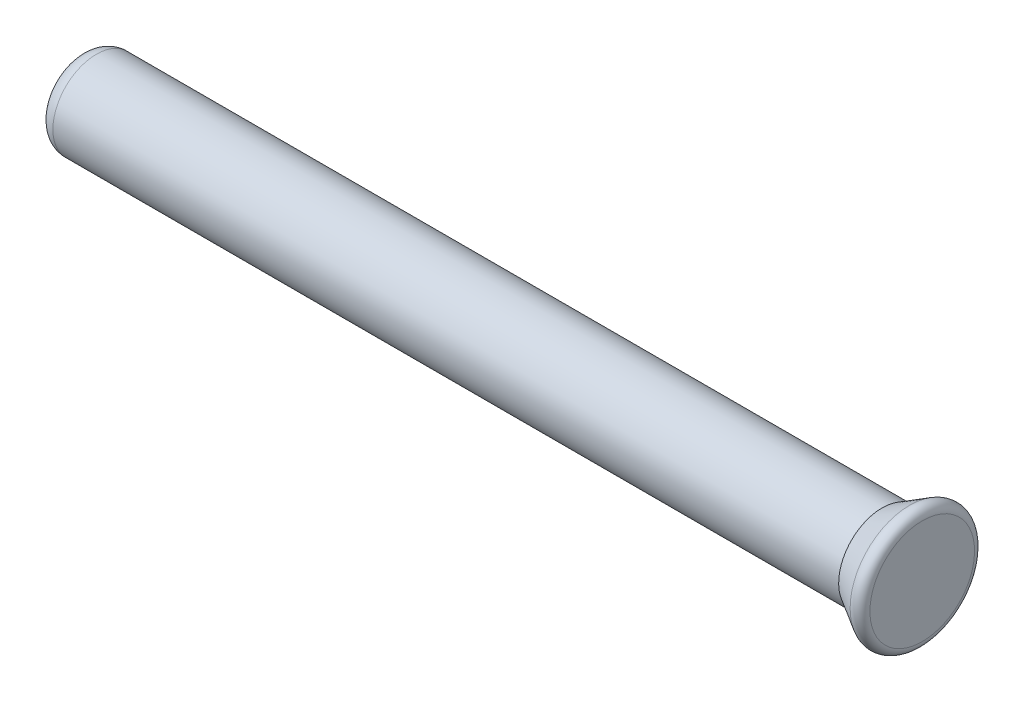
ISO-10303-21;
HEADER;
FILE_DESCRIPTION(('STEP AP214'),'2;1');
FILE_NAME('part.step','',(''),(''),'','','');
FILE_SCHEMA(('AUTOMOTIVE_DESIGN { 1 0 10303 214 1 1 1 1 }'));
ENDSEC;
DATA;
#1=APPLICATION_CONTEXT('core data for automotive mechanical design processes');
#2=APPLICATION_PROTOCOL_DEFINITION('international standard','automotive_design',2000,#1);
#3=PRODUCT_CONTEXT('',#1,'mechanical');
#4=PRODUCT('Part','Part','',(#3));
#5=PRODUCT_RELATED_PRODUCT_CATEGORY('part','',(#4));
#6=PRODUCT_DEFINITION_FORMATION('','',#4);
#7=PRODUCT_DEFINITION_CONTEXT('part definition',#1,'design');
#8=PRODUCT_DEFINITION('design','',#6,#7);
#9=PRODUCT_DEFINITION_SHAPE('','',#8);
#10=(LENGTH_UNIT() NAMED_UNIT(*) SI_UNIT(.MILLI.,.METRE.));
#11=(NAMED_UNIT(*) PLANE_ANGLE_UNIT() SI_UNIT($,.RADIAN.));
#12=(NAMED_UNIT(*) SI_UNIT($,.STERADIAN.) SOLID_ANGLE_UNIT());
#13=UNCERTAINTY_MEASURE_WITH_UNIT(LENGTH_MEASURE(1.E-05),#10,'distance_accuracy_value','');
#14=(GEOMETRIC_REPRESENTATION_CONTEXT(3) GLOBAL_UNCERTAINTY_ASSIGNED_CONTEXT((#13)) GLOBAL_UNIT_ASSIGNED_CONTEXT((#10,
#11,#12)) REPRESENTATION_CONTEXT('',''));
#15=CARTESIAN_POINT('',(0.,0.,0.));
#16=DIRECTION('',(0.,0.,1.));
#17=DIRECTION('',(1.,0.,0.));
#18=AXIS2_PLACEMENT_3D('',#15,#16,#17);
#19=CARTESIAN_POINT('',(0.,0.,0.));
#20=DIRECTION('',(1.,0.,0.));
#21=DIRECTION('',(0.,1.,0.));
#22=AXIS2_PLACEMENT_3D('',#19,#20,#21);
#23=CONICAL_SURFACE('',#22,0.999999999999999,0.528074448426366);
#24=CARTESIAN_POINT('',(-0.187983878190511,0.,0.));
#25=DIRECTION('',(-1.,0.,0.));
#26=DIRECTION('',(0.,-1.,0.));
#27=AXIS2_PLACEMENT_3D('',#24,#25,#26);
#28=CIRCLE('',#27,0.890342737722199);
#29=CARTESIAN_POINT('',(-0.187983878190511,-0.890342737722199,0.));
#30=VERTEX_POINT('',#29);
#31=EDGE_CURVE('E10',#30,#30,#28,.T.);
#32=ORIENTED_EDGE('',*,*,#31,.T.);
#33=EDGE_LOOP('',(#32));
#34=FACE_BOUND('',#33,.T.);
#35=CARTESIAN_POINT('',(-0.6,0.,0.));
#36=DIRECTION('',(1.,0.,0.));
#37=DIRECTION('',(0.,1.,0.));
#38=AXIS2_PLACEMENT_3D('',#35,#36,#37);
#39=CIRCLE('',#38,0.649999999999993);
#40=CARTESIAN_POINT('',(-0.6,0.649999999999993,0.));
#41=VERTEX_POINT('',#40);
#42=EDGE_CURVE('E49',#41,#41,#39,.T.);
#43=ORIENTED_EDGE('',*,*,#42,.T.);
#44=EDGE_LOOP('',(#43));
#45=FACE_BOUND('',#44,.T.);
#46=ADVANCED_FACE('F29',(#34,#45),#23,.T.);
#47=CARTESIAN_POINT('',(0.,0.999999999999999,0.));
#48=DIRECTION('',(1.,0.,0.));
#49=DIRECTION('',(0.,1.,0.));
#50=AXIS2_PLACEMENT_3D('',#47,#48,#49);
#51=PLANE('',#50);
#52=CARTESIAN_POINT('',(0.,0.,0.));
#53=DIRECTION('',(1.,0.,0.));
#54=DIRECTION('',(0.,1.,0.));
#55=AXIS2_PLACEMENT_3D('',#52,#53,#54);
#56=CIRCLE('',#55,0.782370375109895);
#57=CARTESIAN_POINT('',(0.,0.782370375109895,0.));
#58=VERTEX_POINT('',#57);
#59=EDGE_CURVE('E36',#58,#58,#56,.T.);
#60=ORIENTED_EDGE('',*,*,#59,.T.);
#61=EDGE_LOOP('',(#60));
#62=FACE_BOUND('',#61,.T.);
#63=ADVANCED_FACE('F65',(#62),#51,.T.);
#64=CARTESIAN_POINT('',(-12.6,0.649999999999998,0.));
#65=DIRECTION('',(-1.,0.,0.));
#66=DIRECTION('',(0.,-1.,0.));
#67=AXIS2_PLACEMENT_3D('',#64,#65,#66);
#68=PLANE('',#67);
#69=CARTESIAN_POINT('',(-12.6,0.,0.));
#70=DIRECTION('',(-1.,0.,0.));
#71=DIRECTION('',(0.,-1.,0.));
#72=AXIS2_PLACEMENT_3D('',#69,#70,#71);
#73=CIRCLE('',#72,0.399999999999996);
#74=CARTESIAN_POINT('',(-12.6,-0.399999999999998,0.));
#75=VERTEX_POINT('',#74);
#76=EDGE_CURVE('E40',#75,#75,#73,.T.);
#77=ORIENTED_EDGE('',*,*,#76,.T.);
#78=EDGE_LOOP('',(#77));
#79=FACE_BOUND('',#78,.T.);
#80=ADVANCED_FACE('F57',(#79),#68,.T.);
#81=CARTESIAN_POINT('',(0.,0.,0.));
#82=DIRECTION('',(1.,0.,0.));
#83=DIRECTION('',(0.,1.,0.));
#84=AXIS2_PLACEMENT_3D('',#81,#82,#83);
#85=CYLINDRICAL_SURFACE('',#84,0.649999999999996);
#86=CARTESIAN_POINT('',(-12.35,0.,0.));
#87=DIRECTION('',(-1.,0.,0.));
#88=DIRECTION('',(0.,-1.,0.));
#89=AXIS2_PLACEMENT_3D('',#86,#87,#88);
#90=CIRCLE('',#89,0.649999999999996);
#91=CARTESIAN_POINT('',(-12.35,-0.649999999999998,0.));
#92=VERTEX_POINT('',#91);
#93=EDGE_CURVE('E44',#92,#92,#90,.F.);
#94=ORIENTED_EDGE('',*,*,#93,.T.);
#95=EDGE_LOOP('',(#94));
#96=FACE_BOUND('',#95,.T.);
#97=ORIENTED_EDGE('',*,*,#42,.F.);
#98=EDGE_LOOP('',(#97));
#99=FACE_BOUND('',#98,.T.);
#100=ADVANCED_FACE('F54',(#96,#99),#85,.T.);
#101=CARTESIAN_POINT('',(-12.35,0.,0.));
#102=DIRECTION('',(-1.,0.,0.));
#103=DIRECTION('',(0.,-1.,0.));
#104=AXIS2_PLACEMENT_3D('',#101,#102,#103);
#105=TOROIDAL_SURFACE('',#104,0.399999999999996,0.25);
#106=ORIENTED_EDGE('',*,*,#76,.F.);
#107=EDGE_LOOP('',(#106));
#108=FACE_BOUND('',#107,.T.);
#109=ORIENTED_EDGE('',*,*,#93,.F.);
#110=EDGE_LOOP('',(#109));
#111=FACE_BOUND('',#110,.T.);
#112=ADVANCED_FACE('F56',(#108,#111),#105,.T.);
#113=CARTESIAN_POINT('',(-0.124999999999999,0.,0.));
#114=DIRECTION('',(1.,0.,0.));
#115=DIRECTION('',(0.,1.,0.));
#116=AXIS2_PLACEMENT_3D('',#113,#114,#115);
#117=TOROIDAL_SURFACE('',#116,0.782370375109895,0.125);
#118=ORIENTED_EDGE('',*,*,#31,.F.);
#119=EDGE_LOOP('',(#118));
#120=FACE_BOUND('',#119,.T.);
#121=ORIENTED_EDGE('',*,*,#59,.F.);
#122=EDGE_LOOP('',(#121));
#123=FACE_BOUND('',#122,.T.);
#124=ADVANCED_FACE('F31',(#120,#123),#117,.T.);
#125=CLOSED_SHELL('',(#46,#63,#80,#100,#112,#124));
#126=MANIFOLD_SOLID_BREP('B2',#125);
#127=ADVANCED_BREP_SHAPE_REPRESENTATION('',(#18,#126),#14);
#128=SHAPE_DEFINITION_REPRESENTATION(#9,#127);
ENDSEC;
END-ISO-10303-21;
